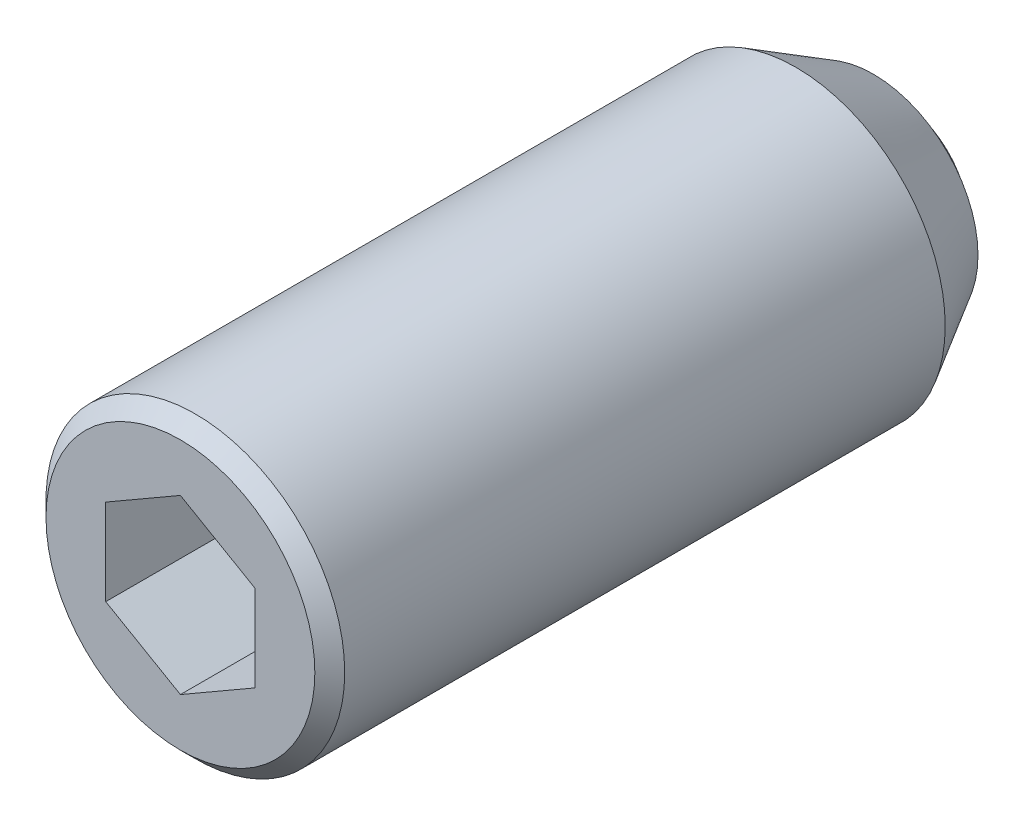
ISO-10303-21;
HEADER;
FILE_DESCRIPTION(('STEP AP214'),'2;1');
FILE_NAME('part.step','',(''),(''),'','','');
FILE_SCHEMA(('AUTOMOTIVE_DESIGN { 1 0 10303 214 1 1 1 1 }'));
ENDSEC;
DATA;
#1=APPLICATION_CONTEXT('core data for automotive mechanical design processes');
#2=APPLICATION_PROTOCOL_DEFINITION('international standard','automotive_design',2000,#1);
#3=PRODUCT_CONTEXT('',#1,'mechanical');
#4=PRODUCT('Part','Part','',(#3));
#5=PRODUCT_RELATED_PRODUCT_CATEGORY('part','',(#4));
#6=PRODUCT_DEFINITION_FORMATION('','',#4);
#7=PRODUCT_DEFINITION_CONTEXT('part definition',#1,'design');
#8=PRODUCT_DEFINITION('design','',#6,#7);
#9=PRODUCT_DEFINITION_SHAPE('','',#8);
#10=(LENGTH_UNIT() NAMED_UNIT(*) SI_UNIT(.MILLI.,.METRE.));
#11=(NAMED_UNIT(*) PLANE_ANGLE_UNIT() SI_UNIT($,.RADIAN.));
#12=(NAMED_UNIT(*) SI_UNIT($,.STERADIAN.) SOLID_ANGLE_UNIT());
#13=UNCERTAINTY_MEASURE_WITH_UNIT(LENGTH_MEASURE(1.E-05),#10,'distance_accuracy_value','');
#14=(GEOMETRIC_REPRESENTATION_CONTEXT(3) GLOBAL_UNCERTAINTY_ASSIGNED_CONTEXT((#13)) GLOBAL_UNIT_ASSIGNED_CONTEXT((#10,
#11,#12)) REPRESENTATION_CONTEXT('',''));
#15=CARTESIAN_POINT('',(0.,0.,0.));
#16=DIRECTION('',(0.,0.,1.));
#17=DIRECTION('',(1.,0.,0.));
#18=AXIS2_PLACEMENT_3D('',#15,#16,#17);
#19=CARTESIAN_POINT('',(1.25,0.721687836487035,9.5));
#20=DIRECTION('',(0.5,0.866025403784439,0.));
#21=DIRECTION('',(0.866025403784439,-0.5,0.));
#22=AXIS2_PLACEMENT_3D('',#19,#20,#21);
#23=PLANE('',#22);
#24=DIRECTION('',(0.,0.,1.));
#25=VECTOR('',#24,1.);
#26=CARTESIAN_POINT('',(1.25,0.721687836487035,9.5));
#27=LINE('',#26,#25);
#28=CARTESIAN_POINT('',(1.25,0.721687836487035,9.5));
#29=VERTEX_POINT('',#28);
#30=CARTESIAN_POINT('',(1.25,0.721687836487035,12.));
#31=VERTEX_POINT('',#30);
#32=EDGE_CURVE('E96',#29,#31,#27,.T.);
#33=ORIENTED_EDGE('',*,*,#32,.T.);
#34=DIRECTION('',(-0.866025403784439,0.5,0.));
#35=VECTOR('',#34,1.);
#36=CARTESIAN_POINT('',(1.25,0.721687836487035,12.));
#37=LINE('',#36,#35);
#38=CARTESIAN_POINT('',(0.,1.44337567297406,12.));
#39=VERTEX_POINT('',#38);
#40=EDGE_CURVE('E29',#31,#39,#37,.T.);
#41=ORIENTED_EDGE('',*,*,#40,.T.);
#42=DIRECTION('',(0.,0.,1.));
#43=VECTOR('',#42,1.);
#44=CARTESIAN_POINT('',(0.,1.44337567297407,9.5));
#45=LINE('',#44,#43);
#46=CARTESIAN_POINT('',(0.,1.44337567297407,9.5));
#47=VERTEX_POINT('',#46);
#48=EDGE_CURVE('E34',#47,#39,#45,.T.);
#49=ORIENTED_EDGE('',*,*,#48,.F.);
#50=DIRECTION('',(-0.866025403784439,0.5,0.));
#51=VECTOR('',#50,1.);
#52=CARTESIAN_POINT('',(1.25,0.721687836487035,9.5));
#53=LINE('',#52,#51);
#54=EDGE_CURVE('E90',#29,#47,#53,.T.);
#55=ORIENTED_EDGE('',*,*,#54,.F.);
#56=EDGE_LOOP('',(#33,#41,#49,#55));
#57=FACE_BOUND('',#56,.T.);
#58=ADVANCED_FACE('F14',(#57),#23,.F.);
#59=CARTESIAN_POINT('',(1.25,-0.721687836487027,9.5));
#60=DIRECTION('',(1.,0.,0.));
#61=DIRECTION('',(0.,-1.,0.));
#62=AXIS2_PLACEMENT_3D('',#59,#60,#61);
#63=PLANE('',#62);
#64=DIRECTION('',(0.,0.,1.));
#65=VECTOR('',#64,1.);
#66=CARTESIAN_POINT('',(1.25,-0.721687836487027,9.5));
#67=LINE('',#66,#65);
#68=CARTESIAN_POINT('',(1.25,-0.721687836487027,9.5));
#69=VERTEX_POINT('',#68);
#70=CARTESIAN_POINT('',(1.25,-0.721687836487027,12.));
#71=VERTEX_POINT('',#70);
#72=EDGE_CURVE('E93',#69,#71,#67,.T.);
#73=ORIENTED_EDGE('',*,*,#72,.T.);
#74=DIRECTION('',(0.,1.,0.));
#75=VECTOR('',#74,1.);
#76=CARTESIAN_POINT('',(1.25,-0.721687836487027,12.));
#77=LINE('',#76,#75);
#78=EDGE_CURVE('E150',#71,#31,#77,.T.);
#79=ORIENTED_EDGE('',*,*,#78,.T.);
#80=ORIENTED_EDGE('',*,*,#32,.F.);
#81=DIRECTION('',(0.,1.,0.));
#82=VECTOR('',#81,1.);
#83=CARTESIAN_POINT('',(1.25,-0.721687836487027,9.5));
#84=LINE('',#83,#82);
#85=EDGE_CURVE('E85',#69,#29,#84,.T.);
#86=ORIENTED_EDGE('',*,*,#85,.F.);
#87=EDGE_LOOP('',(#73,#79,#80,#86));
#88=FACE_BOUND('',#87,.T.);
#89=ADVANCED_FACE('F119',(#88),#63,.F.);
#90=CARTESIAN_POINT('',(1.25,-0.721687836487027,9.5));
#91=DIRECTION('',(-0.5,0.866025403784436,0.));
#92=DIRECTION('',(0.866025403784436,0.5,0.));
#93=AXIS2_PLACEMENT_3D('',#90,#91,#92);
#94=PLANE('',#93);
#95=DIRECTION('',(0.,0.,1.));
#96=VECTOR('',#95,1.);
#97=CARTESIAN_POINT('',(0.,-1.44337567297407,9.5));
#98=LINE('',#97,#96);
#99=CARTESIAN_POINT('',(0.,-1.44337567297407,9.5));
#100=VERTEX_POINT('',#99);
#101=CARTESIAN_POINT('',(0.,-1.44337567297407,12.));
#102=VERTEX_POINT('',#101);
#103=EDGE_CURVE('E68',#100,#102,#98,.T.);
#104=ORIENTED_EDGE('',*,*,#103,.T.);
#105=DIRECTION('',(-0.866025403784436,-0.5,0.));
#106=VECTOR('',#105,1.);
#107=CARTESIAN_POINT('',(1.25,-0.721687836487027,12.));
#108=LINE('',#107,#106);
#109=EDGE_CURVE('E144',#71,#102,#108,.T.);
#110=ORIENTED_EDGE('',*,*,#109,.F.);
#111=ORIENTED_EDGE('',*,*,#72,.F.);
#112=DIRECTION('',(-0.866025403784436,-0.5,0.));
#113=VECTOR('',#112,1.);
#114=CARTESIAN_POINT('',(1.25,-0.721687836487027,9.5));
#115=LINE('',#114,#113);
#116=EDGE_CURVE('E83',#69,#100,#115,.T.);
#117=ORIENTED_EDGE('',*,*,#116,.T.);
#118=EDGE_LOOP('',(#104,#110,#111,#117));
#119=FACE_BOUND('',#118,.T.);
#120=ADVANCED_FACE('F124',(#119),#94,.T.);
#121=CARTESIAN_POINT('',(-1.25,-0.721687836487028,9.5));
#122=DIRECTION('',(-0.5,-0.866025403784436,0.));
#123=DIRECTION('',(-0.866025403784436,0.5,0.));
#124=AXIS2_PLACEMENT_3D('',#121,#122,#123);
#125=PLANE('',#124);
#126=DIRECTION('',(0.,0.,1.));
#127=VECTOR('',#126,1.);
#128=CARTESIAN_POINT('',(-1.25,-0.721687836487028,9.5));
#129=LINE('',#128,#127);
#130=CARTESIAN_POINT('',(-1.25,-0.721687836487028,9.5));
#131=VERTEX_POINT('',#130);
#132=CARTESIAN_POINT('',(-1.25,-0.721687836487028,12.));
#133=VERTEX_POINT('',#132);
#134=EDGE_CURVE('E56',#131,#133,#129,.T.);
#135=ORIENTED_EDGE('',*,*,#134,.T.);
#136=DIRECTION('',(0.866025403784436,-0.5,0.));
#137=VECTOR('',#136,1.);
#138=CARTESIAN_POINT('',(-1.25,-0.721687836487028,12.));
#139=LINE('',#138,#137);
#140=EDGE_CURVE('E147',#133,#102,#139,.T.);
#141=ORIENTED_EDGE('',*,*,#140,.T.);
#142=ORIENTED_EDGE('',*,*,#103,.F.);
#143=DIRECTION('',(0.866025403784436,-0.5,0.));
#144=VECTOR('',#143,1.);
#145=CARTESIAN_POINT('',(-1.25,-0.721687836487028,9.5));
#146=LINE('',#145,#144);
#147=EDGE_CURVE('E76',#131,#100,#146,.T.);
#148=ORIENTED_EDGE('',*,*,#147,.F.);
#149=EDGE_LOOP('',(#135,#141,#142,#148));
#150=FACE_BOUND('',#149,.T.);
#151=ADVANCED_FACE('F81',(#150),#125,.F.);
#152=CARTESIAN_POINT('',(-1.25,-0.721687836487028,9.5));
#153=DIRECTION('',(1.,0.,0.));
#154=DIRECTION('',(0.,0.,1.));
#155=AXIS2_PLACEMENT_3D('',#152,#153,#154);
#156=PLANE('',#155);
#157=DIRECTION('',(0.,0.,1.));
#158=VECTOR('',#157,1.);
#159=CARTESIAN_POINT('',(-1.25,0.72168783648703,9.5));
#160=LINE('',#159,#158);
#161=CARTESIAN_POINT('',(-1.25,0.72168783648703,9.5));
#162=VERTEX_POINT('',#161);
#163=CARTESIAN_POINT('',(-1.25,0.72168783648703,12.));
#164=VERTEX_POINT('',#163);
#165=EDGE_CURVE('E69',#162,#164,#160,.T.);
#166=ORIENTED_EDGE('',*,*,#165,.T.);
#167=DIRECTION('',(0.,1.,0.));
#168=VECTOR('',#167,1.);
#169=CARTESIAN_POINT('',(-1.25,-0.721687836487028,12.));
#170=LINE('',#169,#168);
#171=EDGE_CURVE('E63',#133,#164,#170,.T.);
#172=ORIENTED_EDGE('',*,*,#171,.F.);
#173=ORIENTED_EDGE('',*,*,#134,.F.);
#174=DIRECTION('',(0.,1.,0.));
#175=VECTOR('',#174,1.);
#176=CARTESIAN_POINT('',(-1.25,-0.721687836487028,9.5));
#177=LINE('',#176,#175);
#178=EDGE_CURVE('E60',#131,#162,#177,.T.);
#179=ORIENTED_EDGE('',*,*,#178,.T.);
#180=EDGE_LOOP('',(#166,#172,#173,#179));
#181=FACE_BOUND('',#180,.T.);
#182=ADVANCED_FACE('F59',(#181),#156,.T.);
#183=CARTESIAN_POINT('',(-1.25,0.72168783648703,9.5));
#184=DIRECTION('',(0.5,-0.866025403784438,0.));
#185=DIRECTION('',(-0.866025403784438,-0.5,0.));
#186=AXIS2_PLACEMENT_3D('',#183,#184,#185);
#187=PLANE('',#186);
#188=DIRECTION('',(0.866025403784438,0.5,0.));
#189=VECTOR('',#188,1.);
#190=CARTESIAN_POINT('',(-1.25,0.72168783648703,9.5));
#191=LINE('',#190,#189);
#192=EDGE_CURVE('E79',#162,#47,#191,.T.);
#193=ORIENTED_EDGE('',*,*,#192,.T.);
#194=ORIENTED_EDGE('',*,*,#48,.T.);
#195=DIRECTION('',(0.866025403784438,0.5,0.));
#196=VECTOR('',#195,1.);
#197=CARTESIAN_POINT('',(-1.25,0.72168783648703,12.));
#198=LINE('',#197,#196);
#199=EDGE_CURVE('E157',#164,#39,#198,.T.);
#200=ORIENTED_EDGE('',*,*,#199,.F.);
#201=ORIENTED_EDGE('',*,*,#165,.F.);
#202=EDGE_LOOP('',(#193,#194,#200,#201));
#203=FACE_BOUND('',#202,.T.);
#204=ADVANCED_FACE('F128',(#203),#187,.T.);
#205=CARTESIAN_POINT('',(2.5,0.,9.5));
#206=DIRECTION('',(0.,0.,1.));
#207=DIRECTION('',(-1.,0.,0.));
#208=AXIS2_PLACEMENT_3D('',#205,#206,#207);
#209=PLANE('',#208);
#210=ORIENTED_EDGE('',*,*,#54,.T.);
#211=ORIENTED_EDGE('',*,*,#192,.F.);
#212=ORIENTED_EDGE('',*,*,#178,.F.);
#213=ORIENTED_EDGE('',*,*,#147,.T.);
#214=ORIENTED_EDGE('',*,*,#116,.F.);
#215=ORIENTED_EDGE('',*,*,#85,.T.);
#216=EDGE_LOOP('',(#210,#211,#212,#213,#214,#215));
#217=FACE_BOUND('',#216,.T.);
#218=ADVANCED_FACE('F74',(#217),#209,.T.);
#219=CARTESIAN_POINT('',(0.,0.,11.75));
#220=DIRECTION('',(0.,0.,-1.));
#221=DIRECTION('',(1.,0.,0.));
#222=AXIS2_PLACEMENT_3D('',#219,#220,#221);
#223=CYLINDRICAL_SURFACE('',#222,2.5);
#224=CARTESIAN_POINT('',(0.,0.,11.75));
#225=DIRECTION('',(0.,0.,-1.));
#226=DIRECTION('',(1.,0.,0.));
#227=AXIS2_PLACEMENT_3D('',#224,#225,#226);
#228=CIRCLE('',#227,2.5);
#229=CARTESIAN_POINT('',(2.5,0.,11.75));
#230=VERTEX_POINT('',#229);
#231=EDGE_CURVE('E9',#230,#230,#228,.T.);
#232=ORIENTED_EDGE('',*,*,#231,.T.);
#233=EDGE_LOOP('',(#232));
#234=FACE_BOUND('',#233,.T.);
#235=CARTESIAN_POINT('',(0.,0.,1.69903810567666));
#236=DIRECTION('',(0.,0.,-1.));
#237=DIRECTION('',(-1.,0.,0.));
#238=AXIS2_PLACEMENT_3D('',#235,#236,#237);
#239=CIRCLE('',#238,2.5);
#240=CARTESIAN_POINT('',(-2.5,0.,1.69903810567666));
#241=VERTEX_POINT('',#240);
#242=EDGE_CURVE('E175',#241,#241,#239,.T.);
#243=ORIENTED_EDGE('',*,*,#242,.F.);
#244=EDGE_LOOP('',(#243));
#245=FACE_BOUND('',#244,.T.);
#246=ADVANCED_FACE('F16',(#234,#245),#223,.T.);
#247=CARTESIAN_POINT('',(0.,0.,11.75));
#248=DIRECTION('',(0.,0.,-1.));
#249=DIRECTION('',(1.,0.,0.));
#250=AXIS2_PLACEMENT_3D('',#247,#248,#249);
#251=CONICAL_SURFACE('',#250,2.5,0.785398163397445);
#252=CARTESIAN_POINT('',(0.,0.,12.));
#253=DIRECTION('',(0.,0.,-1.));
#254=DIRECTION('',(1.,0.,0.));
#255=AXIS2_PLACEMENT_3D('',#252,#253,#254);
#256=CIRCLE('',#255,2.25);
#257=CARTESIAN_POINT('',(2.25,0.,12.));
#258=VERTEX_POINT('',#257);
#259=EDGE_CURVE('E22',#258,#258,#256,.T.);
#260=ORIENTED_EDGE('',*,*,#259,.T.);
#261=EDGE_LOOP('',(#260));
#262=FACE_BOUND('',#261,.T.);
#263=ORIENTED_EDGE('',*,*,#231,.F.);
#264=EDGE_LOOP('',(#263));
#265=FACE_BOUND('',#264,.T.);
#266=ADVANCED_FACE('F100',(#262,#265),#251,.T.);
#267=CARTESIAN_POINT('',(0.,0.,12.));
#268=DIRECTION('',(0.,0.,-1.));
#269=DIRECTION('',(1.,0.,0.));
#270=AXIS2_PLACEMENT_3D('',#267,#268,#269);
#271=PLANE('',#270);
#272=ORIENTED_EDGE('',*,*,#199,.T.);
#273=ORIENTED_EDGE('',*,*,#40,.F.);
#274=ORIENTED_EDGE('',*,*,#78,.F.);
#275=ORIENTED_EDGE('',*,*,#109,.T.);
#276=ORIENTED_EDGE('',*,*,#140,.F.);
#277=ORIENTED_EDGE('',*,*,#171,.T.);
#278=EDGE_LOOP('',(#272,#273,#274,#275,#276,#277));
#279=FACE_BOUND('',#278,.T.);
#280=ORIENTED_EDGE('',*,*,#259,.F.);
#281=EDGE_LOOP('',(#280));
#282=FACE_BOUND('',#281,.T.);
#283=ADVANCED_FACE('F103',(#279,#282),#271,.F.);
#284=CARTESIAN_POINT('',(0.,0.,0.));
#285=DIRECTION('',(0.,0.,-1.));
#286=DIRECTION('',(-1.,0.,0.));
#287=AXIS2_PLACEMENT_3D('',#284,#285,#286);
#288=PLANE('',#287);
#289=CARTESIAN_POINT('',(0.,0.,0.));
#290=DIRECTION('',(0.,0.,-1.));
#291=DIRECTION('',(-1.,0.,0.));
#292=AXIS2_PLACEMENT_3D('',#289,#290,#291);
#293=CIRCLE('',#292,1.2);
#294=CARTESIAN_POINT('',(-1.2,0.,0.));
#295=VERTEX_POINT('',#294);
#296=EDGE_CURVE('E152',#295,#295,#293,.T.);
#297=ORIENTED_EDGE('',*,*,#296,.T.);
#298=EDGE_LOOP('',(#297));
#299=FACE_BOUND('',#298,.T.);
#300=ADVANCED_FACE('F105',(#299),#288,.T.);
#301=CARTESIAN_POINT('',(0.,0.,0.9));
#302=DIRECTION('',(0.,0.,-1.));
#303=DIRECTION('',(-1.,0.,0.));
#304=AXIS2_PLACEMENT_3D('',#301,#302,#303);
#305=SPHERICAL_SURFACE('',#304,1.5);
#306=CARTESIAN_POINT('',(0.,0.,0.4));
#307=DIRECTION('',(0.,0.,-1.));
#308=DIRECTION('',(-1.,0.,0.));
#309=AXIS2_PLACEMENT_3D('',#306,#307,#308);
#310=CIRCLE('',#309,1.41421356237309);
#311=CARTESIAN_POINT('',(-1.41421356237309,0.,0.4));
#312=VERTEX_POINT('',#311);
#313=EDGE_CURVE('E169',#312,#312,#310,.T.);
#314=CARTESIAN_POINT('',(-1.41421356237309,0.,0.4));
#315=CARTESIAN_POINT('',(-1.41263197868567,0.,0.395526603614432));
#316=CARTESIAN_POINT('',(-1.41102916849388,0.,0.391060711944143));
#317=CARTESIAN_POINT('',(-1.4077812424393,0.,0.382144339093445));
#318=CARTESIAN_POINT('',(-1.40613612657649,0.,0.377693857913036));
#319=CARTESIAN_POINT('',(-1.40280373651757,0.,0.368808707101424));
#320=CARTESIAN_POINT('',(-1.40111646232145,0.,0.364374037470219));
#321=CARTESIAN_POINT('',(-1.39769990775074,0.,0.355520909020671));
#322=CARTESIAN_POINT('',(-1.39597062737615,0.,0.351102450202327));
#323=CARTESIAN_POINT('',(-1.3924702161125,0.,0.342282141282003));
#324=CARTESIAN_POINT('',(-1.39069908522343,0.,0.337880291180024));
#325=CARTESIAN_POINT('',(-1.38711513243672,0.,0.329093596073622));
#326=CARTESIAN_POINT('',(-1.38530231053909,0.,0.324708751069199));
#327=CARTESIAN_POINT('',(-1.38163513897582,0.,0.315956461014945));
#328=CARTESIAN_POINT('',(-1.37978078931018,0.,0.311589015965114));
#329=CARTESIAN_POINT('',(-1.3760307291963,0.,0.302871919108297));
#330=CARTESIAN_POINT('',(-1.37413501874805,0.,0.29852226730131));
#331=CARTESIAN_POINT('',(-1.37030240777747,0.,0.289841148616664));
#332=CARTESIAN_POINT('',(-1.36836550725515,0.,0.285509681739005));
#333=CARTESIAN_POINT('',(-1.36445069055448,0.,0.276865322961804));
#334=CARTESIAN_POINT('',(-1.36247277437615,0.,0.272552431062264));
#335=CARTESIAN_POINT('',(-1.35847610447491,0.,0.263945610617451));
#336=CARTESIAN_POINT('',(-1.356457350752,0.,0.25965168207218));
#337=CARTESIAN_POINT('',(-1.3523791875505,0.,0.251083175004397));
#338=CARTESIAN_POINT('',(-1.3503197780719,0.,0.246808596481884));
#339=CARTESIAN_POINT('',(-1.34616048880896,0.,0.238279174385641));
#340=CARTESIAN_POINT('',(-1.34406060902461,0.,0.23402433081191));
#341=CARTESIAN_POINT('',(-1.33982056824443,0.,0.225534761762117));
#342=CARTESIAN_POINT('',(-1.33768040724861,0.,0.221300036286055));
#343=CARTESIAN_POINT('',(-1.3333599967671,0.,0.212851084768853));
#344=CARTESIAN_POINT('',(-1.33117974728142,0.,0.208636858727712));
#345=CARTESIAN_POINT('',(-1.32677935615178,0.,0.20022928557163));
#346=CARTESIAN_POINT('',(-1.32455921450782,0.,0.196035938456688));
#347=CARTESIAN_POINT('',(-1.32007923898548,0.,0.187670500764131));
#348=CARTESIAN_POINT('',(-1.31781940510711,0.,0.183498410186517));
#349=CARTESIAN_POINT('',(-1.31326024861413,0.,0.175175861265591));
#350=CARTESIAN_POINT('',(-1.31096092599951,0.,0.171025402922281));
#351=CARTESIAN_POINT('',(-1.30632299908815,0.,0.162746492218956));
#352=CARTESIAN_POINT('',(-1.30398439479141,0.,0.158618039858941));
#353=CARTESIAN_POINT('',(-1.29926811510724,0.,0.150383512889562));
#354=CARTESIAN_POINT('',(-1.29689043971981,0.,0.146277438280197));
#355=CARTESIAN_POINT('',(-1.29209623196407,0.,0.138088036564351));
#356=CARTESIAN_POINT('',(-1.28967969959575,0.,0.13400470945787));
#357=CARTESIAN_POINT('',(-1.2848079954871,0.,0.125861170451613));
#358=CARTESIAN_POINT('',(-1.28235282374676,0.,0.121800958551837));
#359=CARTESIAN_POINT('',(-1.27740406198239,0.,0.113704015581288));
#360=CARTESIAN_POINT('',(-1.27491047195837,0.,0.109667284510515));
#361=CARTESIAN_POINT('',(-1.26988509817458,0.,0.101617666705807));
#362=CARTESIAN_POINT('',(-1.2673533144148,0.,0.0976047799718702));
#363=CARTESIAN_POINT('',(-1.2622517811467,0.,0.0896032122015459));
#364=CARTESIAN_POINT('',(-1.25968203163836,0.,0.0856145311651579));
#365=CARTESIAN_POINT('',(-1.25450479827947,0.,0.0776617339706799));
#366=CARTESIAN_POINT('',(-1.25189731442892,0.,0.0736976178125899));
#367=CARTESIAN_POINT('',(-1.24664484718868,0.,0.0657943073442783));
#368=CARTESIAN_POINT('',(-1.24399986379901,0.,0.0618551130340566));
#369=CARTESIAN_POINT('',(-1.23867263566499,0.,0.0540020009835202));
#370=CARTESIAN_POINT('',(-1.23599039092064,0.,0.0500880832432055));
#371=CARTESIAN_POINT('',(-1.23058888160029,0.,0.0422858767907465));
#372=CARTESIAN_POINT('',(-1.22786961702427,0.,0.0383975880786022));
#373=CARTESIAN_POINT('',(-1.22239431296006,0.,0.0306469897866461));
#374=CARTESIAN_POINT('',(-1.21963827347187,0.,0.0267846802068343));
#375=CARTESIAN_POINT('',(-1.21408966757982,0.,0.0190863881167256));
#376=CARTESIAN_POINT('',(-1.21129710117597,0.,0.0152504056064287));
#377=CARTESIAN_POINT('',(-1.20567569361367,0.,0.00760511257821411));
#378=CARTESIAN_POINT('',(-1.20284685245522,0.,0.00379580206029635));
#379=CARTESIAN_POINT('',(-1.2,0.,0.));
#380=B_SPLINE_CURVE_WITH_KNOTS('',3,(#314,#315,#316,#317,#318,#319,#320,#321,#322,#323,#324,
#325,#326,#327,#328,#329,#330,#331,#332,#333,#334,#335,#336,#337,#338,#339,#340,#341,#342,#343,
#344,#345,#346,#347,#348,#349,#350,#351,#352,#353,#354,#355,#356,#357,#358,#359,#360,#361,#362,
#363,#364,#365,#366,#367,#368,#369,#370,#371,#372,#373,#374,#375,#376,#377,#378,#379),
.UNSPECIFIED.,.F.,.F.,(4,2,2,2,2,2,2,2,2,2,2,2,2,2,2,2,2,2,2,2,2,2,2,2,2,2,2,2,2,2,2,2,4),(0.,
0.0142342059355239,0.0284684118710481,0.0427026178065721,0.0569368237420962,0.0711710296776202,
0.0854052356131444,0.0996394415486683,0.113873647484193,0.128107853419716,0.14234205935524,
0.156576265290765,0.170810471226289,0.185044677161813,0.199278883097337,0.213513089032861,
0.227747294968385,0.241981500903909,0.256215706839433,0.270449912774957,0.284684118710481,
0.298918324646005,0.313152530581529,0.327386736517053,0.341620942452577,0.355855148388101,
0.370089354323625,0.384323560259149,0.398557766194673,0.412791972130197,0.427026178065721,
0.441260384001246,0.45549458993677),.UNSPECIFIED.);
#381=EDGE_CURVE('BSEAM113',#312,#295,#380,.T.);
#382=ORIENTED_EDGE('',*,*,#313,.T.);
#383=ORIENTED_EDGE('',*,*,#296,.F.);
#384=ORIENTED_EDGE('',*,*,#381,.T.);
#385=ORIENTED_EDGE('',*,*,#381,.F.);
#386=EDGE_LOOP('',(#382,#384,#383,#385));
#387=FACE_BOUND('',#386,.T.);
#388=ADVANCED_FACE('F113',(#387),#305,.T.);
#389=CARTESIAN_POINT('',(-1.41421356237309,0.,0.4));
#390=DIRECTION('',(0.,0.,-1.));
#391=DIRECTION('',(-1.,0.,0.));
#392=AXIS2_PLACEMENT_3D('',#389,#390,#391);
#393=PLANE('',#392);
#394=CARTESIAN_POINT('',(0.,0.,0.4));
#395=DIRECTION('',(0.,0.,-1.));
#396=DIRECTION('',(-1.,0.,0.));
#397=AXIS2_PLACEMENT_3D('',#394,#395,#396);
#398=CIRCLE('',#397,1.75);
#399=CARTESIAN_POINT('',(-1.75,0.,0.4));
#400=VERTEX_POINT('',#399);
#401=EDGE_CURVE('E172',#400,#400,#398,.T.);
#402=ORIENTED_EDGE('',*,*,#401,.T.);
#403=EDGE_LOOP('',(#402));
#404=FACE_BOUND('',#403,.T.);
#405=ORIENTED_EDGE('',*,*,#313,.F.);
#406=EDGE_LOOP('',(#405));
#407=FACE_BOUND('',#406,.T.);
#408=ADVANCED_FACE('F252',(#404,#407),#393,.T.);
#409=CARTESIAN_POINT('',(0.,0.,0.4));
#410=DIRECTION('',(0.,0.,1.));
#411=DIRECTION('',(1.,0.,0.));
#412=AXIS2_PLACEMENT_3D('',#409,#410,#411);
#413=CONICAL_SURFACE('',#412,1.75,0.523598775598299);
#414=ORIENTED_EDGE('',*,*,#242,.T.);
#415=EDGE_LOOP('',(#414));
#416=FACE_BOUND('',#415,.T.);
#417=ORIENTED_EDGE('',*,*,#401,.F.);
#418=EDGE_LOOP('',(#417));
#419=FACE_BOUND('',#418,.T.);
#420=ADVANCED_FACE('F179',(#416,#419),#413,.T.);
#421=CLOSED_SHELL('',(#58,#89,#120,#151,#182,#204,#218,#246,#266,#283,#300,#388,#408,#420));
#422=MANIFOLD_SOLID_BREP('B1',#421);
#423=ADVANCED_BREP_SHAPE_REPRESENTATION('',(#18,#422),#14);
#424=SHAPE_DEFINITION_REPRESENTATION(#9,#423);
ENDSEC;
END-ISO-10303-21;
